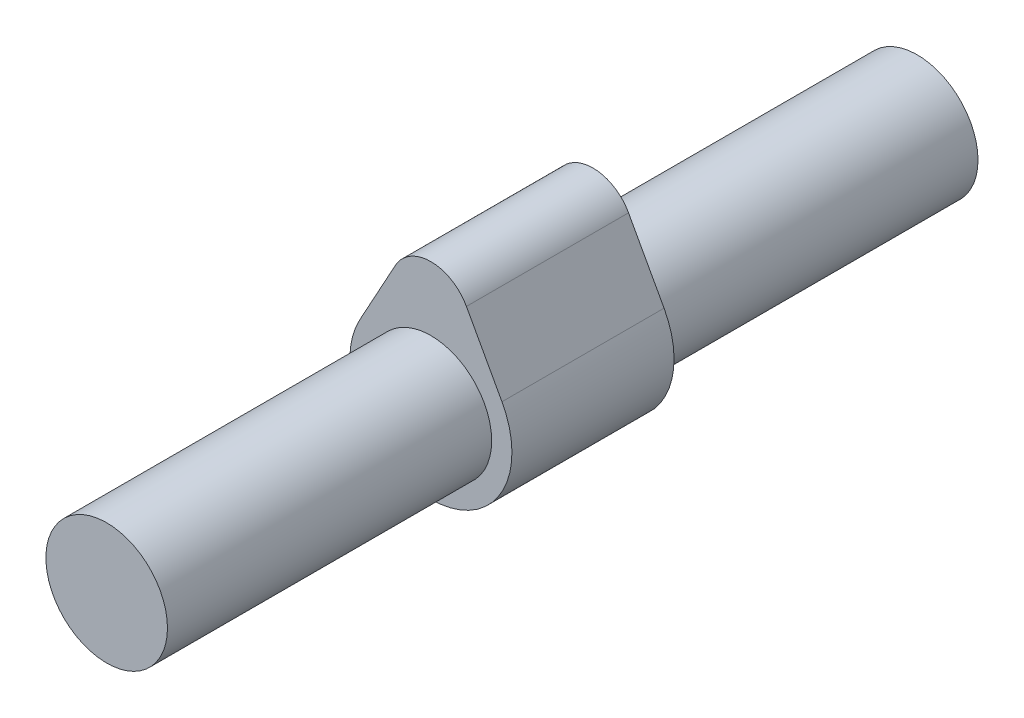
ISO-10303-21;
HEADER;
FILE_DESCRIPTION(('STEP AP214'),'2;1');
FILE_NAME('part.step','',(''),(''),'','','');
FILE_SCHEMA(('AUTOMOTIVE_DESIGN { 1 0 10303 214 1 1 1 1 }'));
ENDSEC;
DATA;
#1=APPLICATION_CONTEXT('core data for automotive mechanical design processes');
#2=APPLICATION_PROTOCOL_DEFINITION('international standard','automotive_design',2000,#1);
#3=PRODUCT_CONTEXT('',#1,'mechanical');
#4=PRODUCT('Part','Part','',(#3));
#5=PRODUCT_RELATED_PRODUCT_CATEGORY('part','',(#4));
#6=PRODUCT_DEFINITION_FORMATION('','',#4);
#7=PRODUCT_DEFINITION_CONTEXT('part definition',#1,'design');
#8=PRODUCT_DEFINITION('design','',#6,#7);
#9=PRODUCT_DEFINITION_SHAPE('','',#8);
#10=(LENGTH_UNIT() NAMED_UNIT(*) SI_UNIT(.MILLI.,.METRE.));
#11=(NAMED_UNIT(*) PLANE_ANGLE_UNIT() SI_UNIT($,.RADIAN.));
#12=(NAMED_UNIT(*) SI_UNIT($,.STERADIAN.) SOLID_ANGLE_UNIT());
#13=UNCERTAINTY_MEASURE_WITH_UNIT(LENGTH_MEASURE(1.E-05),#10,'distance_accuracy_value','');
#14=(GEOMETRIC_REPRESENTATION_CONTEXT(3) GLOBAL_UNCERTAINTY_ASSIGNED_CONTEXT((#13)) GLOBAL_UNIT_ASSIGNED_CONTEXT((#10,
#11,#12)) REPRESENTATION_CONTEXT('',''));
#15=CARTESIAN_POINT('',(0.,0.,0.));
#16=DIRECTION('',(0.,0.,1.));
#17=DIRECTION('',(1.,0.,0.));
#18=AXIS2_PLACEMENT_3D('',#15,#16,#17);
#19=CARTESIAN_POINT('',(0.,0.,-63.5));
#20=DIRECTION('',(0.,0.,1.));
#21=DIRECTION('',(1.,0.,0.));
#22=AXIS2_PLACEMENT_3D('',#19,#20,#21);
#23=CYLINDRICAL_SURFACE('',#22,9.525);
#24=CARTESIAN_POINT('',(0.,0.,-63.5));
#25=DIRECTION('',(0.,0.,1.));
#26=DIRECTION('',(1.,0.,0.));
#27=AXIS2_PLACEMENT_3D('',#24,#25,#26);
#28=CIRCLE('',#27,9.525);
#29=CARTESIAN_POINT('',(9.525,0.,-63.5));
#30=VERTEX_POINT('',#29);
#31=EDGE_CURVE('E51',#30,#30,#28,.T.);
#32=ORIENTED_EDGE('',*,*,#31,.T.);
#33=EDGE_LOOP('',(#32));
#34=FACE_BOUND('',#33,.T.);
#35=CARTESIAN_POINT('',(0.,0.,-12.7));
#36=DIRECTION('',(0.,0.,1.));
#37=DIRECTION('',(1.,0.,0.));
#38=AXIS2_PLACEMENT_3D('',#35,#36,#37);
#39=CIRCLE('',#38,9.525);
#40=CARTESIAN_POINT('',(9.525,0.,-12.7));
#41=VERTEX_POINT('',#40);
#42=EDGE_CURVE('E46',#41,#41,#39,.F.);
#43=ORIENTED_EDGE('',*,*,#42,.T.);
#44=EDGE_LOOP('',(#43));
#45=FACE_BOUND('',#44,.T.);
#46=ADVANCED_FACE('F42',(#34,#45),#23,.T.);
#47=CARTESIAN_POINT('',(0.,0.,-63.5));
#48=DIRECTION('',(0.,0.,1.));
#49=DIRECTION('',(1.,0.,0.));
#50=AXIS2_PLACEMENT_3D('',#47,#48,#49);
#51=PLANE('',#50);
#52=ORIENTED_EDGE('',*,*,#31,.F.);
#53=EDGE_LOOP('',(#52));
#54=FACE_BOUND('',#53,.T.);
#55=ADVANCED_FACE('F145',(#54),#51,.F.);
#56=CARTESIAN_POINT('',(0.,0.,-12.7));
#57=DIRECTION('',(0.,0.,1.));
#58=DIRECTION('',(1.,0.,0.));
#59=AXIS2_PLACEMENT_3D('',#56,#57,#58);
#60=CYLINDRICAL_SURFACE('',#59,12.7);
#61=DIRECTION('',(0.,0.,1.));
#62=VECTOR('',#61,1.);
#63=CARTESIAN_POINT('',(11.1359589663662,6.10576923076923,-12.7));
#64=LINE('',#63,#62);
#65=CARTESIAN_POINT('',(11.1359589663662,6.10576923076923,-12.7));
#66=VERTEX_POINT('',#65);
#67=CARTESIAN_POINT('',(11.1359589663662,6.10576923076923,12.7));
#68=VERTEX_POINT('',#67);
#69=EDGE_CURVE('E83',#66,#68,#64,.T.);
#70=ORIENTED_EDGE('',*,*,#69,.T.);
#71=CARTESIAN_POINT('',(0.,0.,12.7));
#72=DIRECTION('',(0.,0.,1.));
#73=DIRECTION('',(1.,0.,0.));
#74=AXIS2_PLACEMENT_3D('',#71,#72,#73);
#75=CIRCLE('',#74,12.7);
#76=CARTESIAN_POINT('',(-11.1359589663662,6.10576923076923,12.7));
#77=VERTEX_POINT('',#76);
#78=EDGE_CURVE('E87',#77,#68,#75,.T.);
#79=ORIENTED_EDGE('',*,*,#78,.F.);
#80=DIRECTION('',(0.,0.,1.));
#81=VECTOR('',#80,1.);
#82=CARTESIAN_POINT('',(-11.1359589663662,6.10576923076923,-12.7));
#83=LINE('',#82,#81);
#84=CARTESIAN_POINT('',(-11.1359589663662,6.10576923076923,-12.7));
#85=VERTEX_POINT('',#84);
#86=EDGE_CURVE('E58',#85,#77,#83,.T.);
#87=ORIENTED_EDGE('',*,*,#86,.F.);
#88=CARTESIAN_POINT('',(0.,0.,-12.7));
#89=DIRECTION('',(0.,0.,1.));
#90=DIRECTION('',(1.,0.,0.));
#91=AXIS2_PLACEMENT_3D('',#88,#89,#90);
#92=CIRCLE('',#91,12.7);
#93=EDGE_CURVE('E88',#85,#66,#92,.T.);
#94=ORIENTED_EDGE('',*,*,#93,.T.);
#95=EDGE_LOOP('',(#70,#79,#87,#94));
#96=FACE_BOUND('',#95,.T.);
#97=ADVANCED_FACE('F85',(#96),#60,.T.);
#98=CARTESIAN_POINT('',(-5.5679794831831,16.2608846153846,-12.7));
#99=DIRECTION('',(-0.876847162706,0.480769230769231,0.));
#100=DIRECTION('',(-0.480769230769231,-0.876847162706,0.));
#101=AXIS2_PLACEMENT_3D('',#98,#99,#100);
#102=PLANE('',#101);
#103=ORIENTED_EDGE('',*,*,#86,.T.);
#104=DIRECTION('',(-0.480769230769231,-0.876847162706,0.));
#105=VECTOR('',#104,1.);
#106=CARTESIAN_POINT('',(-5.5679794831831,16.2608846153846,12.7));
#107=LINE('',#106,#105);
#108=CARTESIAN_POINT('',(-5.5679794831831,16.2608846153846,12.7));
#109=VERTEX_POINT('',#108);
#110=EDGE_CURVE('E107',#109,#77,#107,.T.);
#111=ORIENTED_EDGE('',*,*,#110,.F.);
#112=DIRECTION('',(0.,0.,1.));
#113=VECTOR('',#112,1.);
#114=CARTESIAN_POINT('',(-5.5679794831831,16.2608846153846,-12.7));
#115=LINE('',#114,#113);
#116=CARTESIAN_POINT('',(-5.5679794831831,16.2608846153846,-12.7));
#117=VERTEX_POINT('',#116);
#118=EDGE_CURVE('E66',#117,#109,#115,.T.);
#119=ORIENTED_EDGE('',*,*,#118,.F.);
#120=DIRECTION('',(-0.480769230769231,-0.876847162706,0.));
#121=VECTOR('',#120,1.);
#122=CARTESIAN_POINT('',(-5.5679794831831,16.2608846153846,-12.7));
#123=LINE('',#122,#121);
#124=EDGE_CURVE('E94',#117,#85,#123,.T.);
#125=ORIENTED_EDGE('',*,*,#124,.T.);
#126=EDGE_LOOP('',(#103,#111,#119,#125));
#127=FACE_BOUND('',#126,.T.);
#128=ADVANCED_FACE('F151',(#127),#102,.T.);
#129=CARTESIAN_POINT('',(0.,13.208,-12.7));
#130=DIRECTION('',(0.,0.,1.));
#131=DIRECTION('',(1.,0.,0.));
#132=AXIS2_PLACEMENT_3D('',#129,#130,#131);
#133=CYLINDRICAL_SURFACE('',#132,6.35);
#134=ORIENTED_EDGE('',*,*,#118,.T.);
#135=CARTESIAN_POINT('',(0.,13.208,12.7));
#136=DIRECTION('',(0.,0.,1.));
#137=DIRECTION('',(1.,0.,0.));
#138=AXIS2_PLACEMENT_3D('',#135,#136,#137);
#139=CIRCLE('',#138,6.35);
#140=CARTESIAN_POINT('',(5.5679794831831,16.2608846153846,12.7));
#141=VERTEX_POINT('',#140);
#142=EDGE_CURVE('E103',#141,#109,#139,.T.);
#143=ORIENTED_EDGE('',*,*,#142,.F.);
#144=DIRECTION('',(0.,0.,1.));
#145=VECTOR('',#144,1.);
#146=CARTESIAN_POINT('',(5.5679794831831,16.2608846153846,-12.7));
#147=LINE('',#146,#145);
#148=CARTESIAN_POINT('',(5.5679794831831,16.2608846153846,-12.7));
#149=VERTEX_POINT('',#148);
#150=EDGE_CURVE('E93',#149,#141,#147,.T.);
#151=ORIENTED_EDGE('',*,*,#150,.F.);
#152=CARTESIAN_POINT('',(0.,13.208,-12.7));
#153=DIRECTION('',(0.,0.,1.));
#154=DIRECTION('',(1.,0.,0.));
#155=AXIS2_PLACEMENT_3D('',#152,#153,#154);
#156=CIRCLE('',#155,6.35);
#157=EDGE_CURVE('E128',#149,#117,#156,.T.);
#158=ORIENTED_EDGE('',*,*,#157,.T.);
#159=EDGE_LOOP('',(#134,#143,#151,#158));
#160=FACE_BOUND('',#159,.T.);
#161=ADVANCED_FACE('F161',(#160),#133,.T.);
#162=CARTESIAN_POINT('',(5.5679794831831,16.2608846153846,-12.7));
#163=DIRECTION('',(0.876847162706,0.480769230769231,0.));
#164=DIRECTION('',(-0.480769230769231,0.876847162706,0.));
#165=AXIS2_PLACEMENT_3D('',#162,#163,#164);
#166=PLANE('',#165);
#167=ORIENTED_EDGE('',*,*,#150,.T.);
#168=DIRECTION('',(-0.480769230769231,0.876847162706,0.));
#169=VECTOR('',#168,1.);
#170=CARTESIAN_POINT('',(5.5679794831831,16.2608846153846,12.7));
#171=LINE('',#170,#169);
#172=EDGE_CURVE('E97',#68,#141,#171,.T.);
#173=ORIENTED_EDGE('',*,*,#172,.F.);
#174=ORIENTED_EDGE('',*,*,#69,.F.);
#175=DIRECTION('',(-0.480769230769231,0.876847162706,0.));
#176=VECTOR('',#175,1.);
#177=CARTESIAN_POINT('',(5.5679794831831,16.2608846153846,-12.7));
#178=LINE('',#177,#176);
#179=EDGE_CURVE('E125',#66,#149,#178,.T.);
#180=ORIENTED_EDGE('',*,*,#179,.T.);
#181=EDGE_LOOP('',(#167,#173,#174,#180));
#182=FACE_BOUND('',#181,.T.);
#183=ADVANCED_FACE('F98',(#182),#166,.T.);
#184=CARTESIAN_POINT('',(0.,0.,-12.7));
#185=DIRECTION('',(0.,0.,1.));
#186=DIRECTION('',(1.,0.,0.));
#187=AXIS2_PLACEMENT_3D('',#184,#185,#186);
#188=PLANE('',#187);
#189=ORIENTED_EDGE('',*,*,#42,.F.);
#190=EDGE_LOOP('',(#189));
#191=FACE_BOUND('',#190,.T.);
#192=ORIENTED_EDGE('',*,*,#93,.F.);
#193=ORIENTED_EDGE('',*,*,#124,.F.);
#194=ORIENTED_EDGE('',*,*,#157,.F.);
#195=ORIENTED_EDGE('',*,*,#179,.F.);
#196=EDGE_LOOP('',(#192,#193,#194,#195));
#197=FACE_BOUND('',#196,.T.);
#198=ADVANCED_FACE('F160',(#191,#197),#188,.F.);
#199=CARTESIAN_POINT('',(0.,0.,12.7));
#200=DIRECTION('',(0.,0.,1.));
#201=DIRECTION('',(1.,0.,0.));
#202=AXIS2_PLACEMENT_3D('',#199,#200,#201);
#203=PLANE('',#202);
#204=CARTESIAN_POINT('',(0.,0.,12.7));
#205=DIRECTION('',(0.,0.,1.));
#206=DIRECTION('',(1.,0.,0.));
#207=AXIS2_PLACEMENT_3D('',#204,#205,#206);
#208=CIRCLE('',#207,9.525);
#209=CARTESIAN_POINT('',(9.525,0.,12.7));
#210=VERTEX_POINT('',#209);
#211=EDGE_CURVE('E12',#210,#210,#208,.F.);
#212=ORIENTED_EDGE('',*,*,#211,.T.);
#213=EDGE_LOOP('',(#212));
#214=FACE_BOUND('',#213,.T.);
#215=ORIENTED_EDGE('',*,*,#78,.T.);
#216=ORIENTED_EDGE('',*,*,#172,.T.);
#217=ORIENTED_EDGE('',*,*,#142,.T.);
#218=ORIENTED_EDGE('',*,*,#110,.T.);
#219=EDGE_LOOP('',(#215,#216,#217,#218));
#220=FACE_BOUND('',#219,.T.);
#221=ADVANCED_FACE('F106',(#214,#220),#203,.T.);
#222=CARTESIAN_POINT('',(0.,0.,63.5));
#223=DIRECTION('',(0.,0.,1.));
#224=DIRECTION('',(1.,0.,0.));
#225=AXIS2_PLACEMENT_3D('',#222,#223,#224);
#226=PLANE('',#225);
#227=CARTESIAN_POINT('',(0.,0.,63.5));
#228=DIRECTION('',(0.,0.,1.));
#229=DIRECTION('',(1.,0.,0.));
#230=AXIS2_PLACEMENT_3D('',#227,#228,#229);
#231=CIRCLE('',#230,9.525);
#232=CARTESIAN_POINT('',(9.525,0.,63.5));
#233=VERTEX_POINT('',#232);
#234=EDGE_CURVE('E137',#233,#233,#231,.T.);
#235=ORIENTED_EDGE('',*,*,#234,.T.);
#236=EDGE_LOOP('',(#235));
#237=FACE_BOUND('',#236,.T.);
#238=ADVANCED_FACE('F154',(#237),#226,.T.);
#239=ORIENTED_EDGE('',*,*,#211,.F.);
#240=EDGE_LOOP('',(#239));
#241=FACE_BOUND('',#240,.T.);
#242=ORIENTED_EDGE('',*,*,#234,.F.);
#243=EDGE_LOOP('',(#242));
#244=FACE_BOUND('',#243,.T.);
#245=ADVANCED_FACE('F44',(#241,#244),#23,.T.);
#246=CLOSED_SHELL('',(#46,#55,#97,#128,#161,#183,#198,#221,#238,#245));
#247=MANIFOLD_SOLID_BREP('B2',#246);
#248=ADVANCED_BREP_SHAPE_REPRESENTATION('',(#18,#247),#14);
#249=SHAPE_DEFINITION_REPRESENTATION(#9,#248);
ENDSEC;
END-ISO-10303-21;
